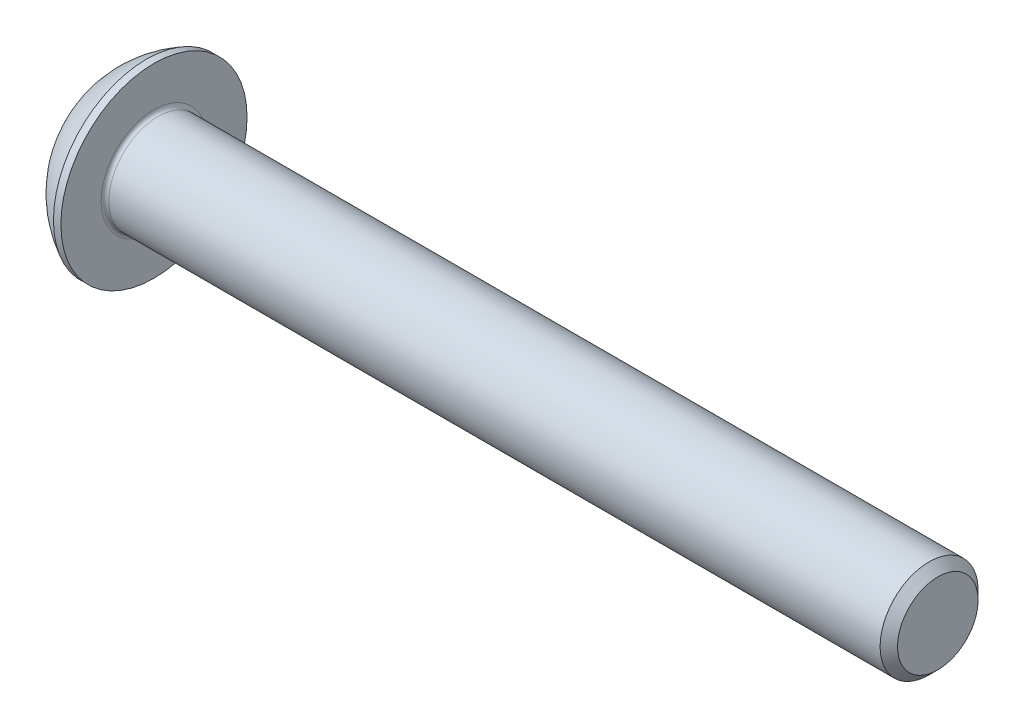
ISO-10303-21;
HEADER;
FILE_DESCRIPTION(('STEP AP214'),'2;1');
FILE_NAME('part.step','',(''),(''),'','','');
FILE_SCHEMA(('AUTOMOTIVE_DESIGN { 1 0 10303 214 1 1 1 1 }'));
ENDSEC;
DATA;
#1=APPLICATION_CONTEXT('core data for automotive mechanical design processes');
#2=APPLICATION_PROTOCOL_DEFINITION('international standard','automotive_design',2000,#1);
#3=PRODUCT_CONTEXT('',#1,'mechanical');
#4=PRODUCT('Part','Part','',(#3));
#5=PRODUCT_RELATED_PRODUCT_CATEGORY('part','',(#4));
#6=PRODUCT_DEFINITION_FORMATION('','',#4);
#7=PRODUCT_DEFINITION_CONTEXT('part definition',#1,'design');
#8=PRODUCT_DEFINITION('design','',#6,#7);
#9=PRODUCT_DEFINITION_SHAPE('','',#8);
#10=(LENGTH_UNIT() NAMED_UNIT(*) SI_UNIT(.MILLI.,.METRE.));
#11=(NAMED_UNIT(*) PLANE_ANGLE_UNIT() SI_UNIT($,.RADIAN.));
#12=(NAMED_UNIT(*) SI_UNIT($,.STERADIAN.) SOLID_ANGLE_UNIT());
#13=UNCERTAINTY_MEASURE_WITH_UNIT(LENGTH_MEASURE(1.E-05),#10,'distance_accuracy_value','');
#14=(GEOMETRIC_REPRESENTATION_CONTEXT(3) GLOBAL_UNCERTAINTY_ASSIGNED_CONTEXT((#13)) GLOBAL_UNIT_ASSIGNED_CONTEXT((#10,
#11,#12)) REPRESENTATION_CONTEXT('',''));
#15=CARTESIAN_POINT('',(0.,0.,0.));
#16=DIRECTION('',(0.,0.,1.));
#17=DIRECTION('',(1.,0.,0.));
#18=AXIS2_PLACEMENT_3D('',#15,#16,#17);
#19=CARTESIAN_POINT('',(0.,0.,0.));
#20=DIRECTION('',(-1.,0.,0.));
#21=DIRECTION('',(0.,0.,1.));
#22=AXIS2_PLACEMENT_3D('',#19,#20,#21);
#23=PLANE('',#22);
#24=CARTESIAN_POINT('',(0.,0.,0.));
#25=DIRECTION('',(-1.,0.,0.));
#26=DIRECTION('',(0.,0.,1.));
#27=AXIS2_PLACEMENT_3D('',#24,#25,#26);
#28=CIRCLE('',#27,2.375);
#29=CARTESIAN_POINT('',(0.,2.375,0.));
#30=VERTEX_POINT('',#29);
#31=EDGE_CURVE('E151',#30,#30,#28,.T.);
#32=ORIENTED_EDGE('',*,*,#31,.T.);
#33=EDGE_LOOP('',(#32));
#34=FACE_BOUND('',#33,.T.);
#35=DIRECTION('',(0.,-1.,0.));
#36=VECTOR('',#35,1.);
#37=CARTESIAN_POINT('',(0.,-0.866025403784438,1.5));
#38=LINE('',#37,#36);
#39=CARTESIAN_POINT('',(0.,0.866025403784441,1.5));
#40=VERTEX_POINT('',#39);
#41=CARTESIAN_POINT('',(0.,-0.866025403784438,1.5));
#42=VERTEX_POINT('',#41);
#43=EDGE_CURVE('E46',#40,#42,#38,.T.);
#44=ORIENTED_EDGE('',*,*,#43,.T.);
#45=DIRECTION('',(0.,-0.5,-0.866025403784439));
#46=VECTOR('',#45,1.);
#47=CARTESIAN_POINT('',(0.,-1.73205080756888,0.));
#48=LINE('',#47,#46);
#49=CARTESIAN_POINT('',(0.,-1.73205080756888,0.));
#50=VERTEX_POINT('',#49);
#51=EDGE_CURVE('E271',#42,#50,#48,.T.);
#52=ORIENTED_EDGE('',*,*,#51,.T.);
#53=DIRECTION('',(0.,0.5,-0.866025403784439));
#54=VECTOR('',#53,1.);
#55=CARTESIAN_POINT('',(0.,-0.866025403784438,-1.5));
#56=LINE('',#55,#54);
#57=CARTESIAN_POINT('',(0.,-0.866025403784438,-1.5));
#58=VERTEX_POINT('',#57);
#59=EDGE_CURVE('E126',#50,#58,#56,.T.);
#60=ORIENTED_EDGE('',*,*,#59,.T.);
#61=DIRECTION('',(0.,1.,0.));
#62=VECTOR('',#61,1.);
#63=CARTESIAN_POINT('',(0.,0.866025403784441,-1.5));
#64=LINE('',#63,#62);
#65=CARTESIAN_POINT('',(0.,0.866025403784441,-1.5));
#66=VERTEX_POINT('',#65);
#67=EDGE_CURVE('E274',#58,#66,#64,.T.);
#68=ORIENTED_EDGE('',*,*,#67,.T.);
#69=DIRECTION('',(0.,0.499999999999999,0.866025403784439));
#70=VECTOR('',#69,1.);
#71=CARTESIAN_POINT('',(0.,1.73205080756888,0.));
#72=LINE('',#71,#70);
#73=CARTESIAN_POINT('',(0.,1.73205080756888,0.));
#74=VERTEX_POINT('',#73);
#75=EDGE_CURVE('E276',#66,#74,#72,.T.);
#76=ORIENTED_EDGE('',*,*,#75,.T.);
#77=DIRECTION('',(0.,-0.499999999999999,0.866025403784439));
#78=VECTOR('',#77,1.);
#79=CARTESIAN_POINT('',(0.,0.866025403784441,1.5));
#80=LINE('',#79,#78);
#81=EDGE_CURVE('E278',#74,#40,#80,.T.);
#82=ORIENTED_EDGE('',*,*,#81,.T.);
#83=EDGE_LOOP('',(#44,#52,#60,#68,#76,#82));
#84=FACE_BOUND('',#83,.T.);
#85=ADVANCED_FACE('F31',(#34,#84),#23,.T.);
#86=CARTESIAN_POINT('',(4.75501582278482,0.,0.));
#87=DIRECTION('',(-1.,0.,0.));
#88=DIRECTION('',(0.,1.,0.));
#89=AXIS2_PLACEMENT_3D('',#86,#87,#88);
#90=SPHERICAL_SURFACE('',#89,5.3151482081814);
#91=CARTESIAN_POINT('',(2.37,0.,0.));
#92=DIRECTION('',(-1.,0.,0.));
#93=DIRECTION('',(0.,0.,1.));
#94=AXIS2_PLACEMENT_3D('',#91,#92,#93);
#95=CIRCLE('',#94,4.75);
#96=CARTESIAN_POINT('',(2.37,4.75,0.));
#97=VERTEX_POINT('',#96);
#98=EDGE_CURVE('E148',#97,#97,#95,.T.);
#99=CARTESIAN_POINT('',(2.37,4.75,0.));
#100=CARTESIAN_POINT('',(2.33822259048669,4.7340443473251,0.));
#101=CARTESIAN_POINT('',(2.30660534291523,4.71776971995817,0.));
#102=CARTESIAN_POINT('',(2.24370380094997,4.68458927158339,0.));
#103=CARTESIAN_POINT('',(2.21241950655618,4.66768345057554,0.));
#104=CARTESIAN_POINT('',(2.15019650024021,4.6332473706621,0.));
#105=CARTESIAN_POINT('',(2.11925778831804,4.6157171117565,0.));
#106=CARTESIAN_POINT('',(2.05773840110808,4.58003923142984,0.));
#107=CARTESIAN_POINT('',(2.02715772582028,4.56189161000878,0.));
#108=CARTESIAN_POINT('',(1.96636673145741,4.52498631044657,0.));
#109=CARTESIAN_POINT('',(1.93615641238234,4.50622863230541,0.));
#110=CARTESIAN_POINT('',(1.87611829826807,4.46811077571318,0.));
#111=CARTESIAN_POINT('',(1.84629050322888,4.4487505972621,0.));
#112=CARTESIAN_POINT('',(1.78702945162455,4.40943553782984,0.));
#113=CARTESIAN_POINT('',(1.75759619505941,4.38948065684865,0.));
#114=CARTESIAN_POINT('',(1.69913607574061,4.34898423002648,0.));
#115=CARTESIAN_POINT('',(1.67010921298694,4.32844268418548,0.));
#116=CARTESIAN_POINT('',(1.61247357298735,4.28678120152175,0.));
#117=CARTESIAN_POINT('',(1.58386479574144,4.265661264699,0.));
#118=CARTESIAN_POINT('',(1.52707685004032,4.22285150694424,0.));
#119=CARTESIAN_POINT('',(1.49889768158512,4.20116168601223,0.));
#120=CARTESIAN_POINT('',(1.44298030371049,4.15722089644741,0.));
#121=CARTESIAN_POINT('',(1.41524209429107,4.13496992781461,0.));
#122=CARTESIAN_POINT('',(1.36021780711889,4.08991580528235,0.));
#123=CARTESIAN_POINT('',(1.33293172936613,4.06711265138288,0.));
#124=CARTESIAN_POINT('',(1.278822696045,4.02096334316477,0.));
#125=CARTESIAN_POINT('',(1.25199974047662,3.99761718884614,0.));
#126=CARTESIAN_POINT('',(1.19882775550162,3.95039128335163,0.));
#127=CARTESIAN_POINT('',(1.172478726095,3.92651153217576,0.));
#128=CARTESIAN_POINT('',(1.1202652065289,3.87822805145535,0.));
#129=CARTESIAN_POINT('',(1.09440071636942,3.85382432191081,0.));
#130=CARTESIAN_POINT('',(1.04316669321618,3.8045027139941,0.));
#131=CARTESIAN_POINT('',(1.01779716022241,3.77958483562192,0.));
#132=CARTESIAN_POINT('',(0.967563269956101,3.72924496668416,0.));
#133=CARTESIAN_POINT('',(0.942698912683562,3.70382297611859,0.));
#134=CARTESIAN_POINT('',(0.89348538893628,3.65248512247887,0.));
#135=CARTESIAN_POINT('',(0.869136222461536,3.62656925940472,0.));
#136=CARTESIAN_POINT('',(0.82096288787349,3.57425409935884,0.));
#137=CARTESIAN_POINT('',(0.797138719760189,3.54785480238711,0.));
#138=CARTESIAN_POINT('',(0.750024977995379,3.49458340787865,0.));
#139=CARTESIAN_POINT('',(0.72673540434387,3.46771131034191,0.));
#140=CARTESIAN_POINT('',(0.680700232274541,3.41350513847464,0.));
#141=CARTESIAN_POINT('',(0.657954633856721,3.3861710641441,0.));
#142=CARTESIAN_POINT('',(0.613016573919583,3.33105194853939,0.));
#143=CARTESIAN_POINT('',(0.590824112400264,3.30326690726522,0.));
#144=CARTESIAN_POINT('',(0.547001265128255,3.24725704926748,0.));
#145=CARTESIAN_POINT('',(0.525370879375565,3.21903223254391,0.));
#146=CARTESIAN_POINT('',(0.48268089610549,3.16215419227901,0.));
#147=CARTESIAN_POINT('',(0.461621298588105,3.13350096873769,0.));
#148=CARTESIAN_POINT('',(0.420081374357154,3.07577765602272,0.));
#149=CARTESIAN_POINT('',(0.399601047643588,3.04670756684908,0.));
#150=CARTESIAN_POINT('',(0.359227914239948,2.98816223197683,0.));
#151=CARTESIAN_POINT('',(0.339335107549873,2.95868698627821,0.));
#152=CARTESIAN_POINT('',(0.300145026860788,2.89934321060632,0.));
#153=CARTESIAN_POINT('',(0.280847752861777,2.86947468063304,0.));
#154=CARTESIAN_POINT('',(0.242856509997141,2.80935636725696,0.));
#155=CARTESIAN_POINT('',(0.224162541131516,2.77910658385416,0.));
#156=CARTESIAN_POINT('',(0.187385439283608,2.71823794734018,0.));
#157=CARTESIAN_POINT('',(0.169302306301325,2.68761909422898,0.));
#158=CARTESIAN_POINT('',(0.133754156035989,2.626024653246,0.));
#159=CARTESIAN_POINT('',(0.116289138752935,2.59504906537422,0.));
#160=CARTESIAN_POINT('',(0.081984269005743,2.53275362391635,0.));
#161=CARTESIAN_POINT('',(0.065144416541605,2.50143377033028,0.));
#162=CARTESIAN_POINT('',(0.0320966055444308,2.43846244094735,0.));
#163=CARTESIAN_POINT('',(0.0158886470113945,2.40681096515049,0.));
#164=CARTESIAN_POINT('',(0.,2.375,0.));
#165=B_SPLINE_CURVE_WITH_KNOTS('',3,(#99,#100,#101,#102,#103,#104,#105,#106,#107,#108,#109,#110,
#111,#112,#113,#114,#115,#116,#117,#118,#119,#120,#121,#122,#123,#124,#125,#126,#127,#128,#129,
#130,#131,#132,#133,#134,#135,#136,#137,#138,#139,#140,#141,#142,#143,#144,#145,#146,#147,#148,
#149,#150,#151,#152,#153,#154,#155,#156,#157,#158,#159,#160,#161,#162,#163,#164),.UNSPECIFIED.,
.F.,.F.,(4,2,2,2,2,2,2,2,2,2,2,2,2,2,2,2,2,2,2,2,2,2,2,2,2,2,2,2,2,2,2,2,4),(0.,
0.106672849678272,0.213345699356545,0.320018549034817,0.426691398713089,0.533364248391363,
0.640037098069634,0.746709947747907,0.85338279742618,0.960055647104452,1.06672849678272,
1.173401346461,1.28007419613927,1.38674704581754,1.49341989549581,1.60009274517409,
1.70676559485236,1.81343844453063,1.9201112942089,2.02678414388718,2.13345699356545,
2.24012984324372,2.34680269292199,2.45347554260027,2.56014839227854,2.66682124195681,
2.77349409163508,2.88016694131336,2.98683979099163,3.0935126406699,3.20018549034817,
3.30685834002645,3.41353118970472),.UNSPECIFIED.);
#166=EDGE_CURVE('BSEAM172',#97,#30,#165,.T.);
#167=ORIENTED_EDGE('',*,*,#98,.T.);
#168=ORIENTED_EDGE('',*,*,#31,.F.);
#169=ORIENTED_EDGE('',*,*,#166,.T.);
#170=ORIENTED_EDGE('',*,*,#166,.F.);
#171=EDGE_LOOP('',(#167,#169,#168,#170));
#172=FACE_BOUND('',#171,.T.);
#173=ADVANCED_FACE('F172',(#172),#90,.T.);
#174=CARTESIAN_POINT('',(0.,0.,0.));
#175=DIRECTION('',(-1.,0.,0.));
#176=DIRECTION('',(0.,0.,1.));
#177=AXIS2_PLACEMENT_3D('',#174,#175,#176);
#178=CYLINDRICAL_SURFACE('',#177,4.75);
#179=ORIENTED_EDGE('',*,*,#98,.F.);
#180=EDGE_LOOP('',(#179));
#181=FACE_BOUND('',#180,.T.);
#182=CARTESIAN_POINT('',(2.75,0.,0.));
#183=DIRECTION('',(-1.,0.,0.));
#184=DIRECTION('',(0.,0.,1.));
#185=AXIS2_PLACEMENT_3D('',#182,#183,#184);
#186=CIRCLE('',#185,4.75);
#187=CARTESIAN_POINT('',(2.75,0.,4.75));
#188=VERTEX_POINT('',#187);
#189=EDGE_CURVE('E145',#188,#188,#186,.T.);
#190=ORIENTED_EDGE('',*,*,#189,.T.);
#191=EDGE_LOOP('',(#190));
#192=FACE_BOUND('',#191,.T.);
#193=ADVANCED_FACE('F177',(#181,#192),#178,.T.);
#194=CARTESIAN_POINT('',(2.75,2.49999999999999,0.));
#195=DIRECTION('',(-1.,0.,0.));
#196=DIRECTION('',(0.,0.,1.));
#197=AXIS2_PLACEMENT_3D('',#194,#195,#196);
#198=PLANE('',#197);
#199=CARTESIAN_POINT('',(2.75,0.,0.));
#200=DIRECTION('',(-1.,0.,0.));
#201=DIRECTION('',(0.,0.,1.));
#202=AXIS2_PLACEMENT_3D('',#199,#200,#201);
#203=CIRCLE('',#202,2.7);
#204=CARTESIAN_POINT('',(2.75,0.,2.7));
#205=VERTEX_POINT('',#204);
#206=EDGE_CURVE('E39',#205,#205,#203,.T.);
#207=ORIENTED_EDGE('',*,*,#206,.T.);
#208=EDGE_LOOP('',(#207));
#209=FACE_BOUND('',#208,.T.);
#210=ORIENTED_EDGE('',*,*,#189,.F.);
#211=EDGE_LOOP('',(#210));
#212=FACE_BOUND('',#211,.T.);
#213=ADVANCED_FACE('F156',(#209,#212),#198,.F.);
#214=CARTESIAN_POINT('',(0.,0.,0.));
#215=DIRECTION('',(-1.,0.,0.));
#216=DIRECTION('',(0.,0.,1.));
#217=AXIS2_PLACEMENT_3D('',#214,#215,#216);
#218=CYLINDRICAL_SURFACE('',#217,2.5);
#219=CARTESIAN_POINT('',(2.95,0.,0.));
#220=DIRECTION('',(-1.,0.,0.));
#221=DIRECTION('',(0.,0.,1.));
#222=AXIS2_PLACEMENT_3D('',#219,#220,#221);
#223=CIRCLE('',#222,2.5);
#224=CARTESIAN_POINT('',(2.95,0.,2.5));
#225=VERTEX_POINT('',#224);
#226=EDGE_CURVE('E11',#225,#225,#223,.F.);
#227=ORIENTED_EDGE('',*,*,#226,.T.);
#228=EDGE_LOOP('',(#227));
#229=FACE_BOUND('',#228,.T.);
#230=CARTESIAN_POINT('',(42.305,0.,0.));
#231=DIRECTION('',(-1.,0.,0.));
#232=DIRECTION('',(0.,0.,1.));
#233=AXIS2_PLACEMENT_3D('',#230,#231,#232);
#234=CIRCLE('',#233,2.5);
#235=CARTESIAN_POINT('',(42.305,0.,2.5));
#236=VERTEX_POINT('',#235);
#237=EDGE_CURVE('E142',#236,#236,#234,.T.);
#238=ORIENTED_EDGE('',*,*,#237,.T.);
#239=EDGE_LOOP('',(#238));
#240=FACE_BOUND('',#239,.T.);
#241=ADVANCED_FACE('F186',(#229,#240),#218,.T.);
#242=CARTESIAN_POINT('',(42.75,0.,0.));
#243=DIRECTION('',(-1.,0.,0.));
#244=DIRECTION('',(0.,0.,1.));
#245=AXIS2_PLACEMENT_3D('',#242,#243,#244);
#246=CONICAL_SURFACE('',#245,2.055,0.785398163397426);
#247=ORIENTED_EDGE('',*,*,#237,.F.);
#248=EDGE_LOOP('',(#247));
#249=FACE_BOUND('',#248,.T.);
#250=CARTESIAN_POINT('',(42.75,0.,0.));
#251=DIRECTION('',(-1.,0.,0.));
#252=DIRECTION('',(0.,0.,1.));
#253=AXIS2_PLACEMENT_3D('',#250,#251,#252);
#254=CIRCLE('',#253,2.055);
#255=CARTESIAN_POINT('',(42.75,0.,2.055));
#256=VERTEX_POINT('',#255);
#257=EDGE_CURVE('E138',#256,#256,#254,.T.);
#258=ORIENTED_EDGE('',*,*,#257,.T.);
#259=EDGE_LOOP('',(#258));
#260=FACE_BOUND('',#259,.T.);
#261=ADVANCED_FACE('F167',(#249,#260),#246,.T.);
#262=CARTESIAN_POINT('',(42.75,0.,0.));
#263=DIRECTION('',(-1.,0.,0.));
#264=DIRECTION('',(0.,0.,1.));
#265=AXIS2_PLACEMENT_3D('',#262,#263,#264);
#266=PLANE('',#265);
#267=ORIENTED_EDGE('',*,*,#257,.F.);
#268=EDGE_LOOP('',(#267));
#269=FACE_BOUND('',#268,.T.);
#270=ADVANCED_FACE('F160',(#269),#266,.F.);
#271=CARTESIAN_POINT('',(2.95,0.,0.));
#272=DIRECTION('',(-1.,0.,0.));
#273=DIRECTION('',(0.,0.,1.));
#274=AXIS2_PLACEMENT_3D('',#271,#272,#273);
#275=TOROIDAL_SURFACE('',#274,2.7,0.2);
#276=ORIENTED_EDGE('',*,*,#226,.F.);
#277=EDGE_LOOP('',(#276));
#278=FACE_BOUND('',#277,.T.);
#279=ORIENTED_EDGE('',*,*,#206,.F.);
#280=EDGE_LOOP('',(#279));
#281=FACE_BOUND('',#280,.T.);
#282=ADVANCED_FACE('F33',(#278,#281),#275,.F.);
#283=CARTESIAN_POINT('',(1.56,-1.73205080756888,0.));
#284=DIRECTION('',(0.,0.866025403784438,-0.5));
#285=DIRECTION('',(0.,0.5,0.866025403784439));
#286=AXIS2_PLACEMENT_3D('',#283,#284,#285);
#287=PLANE('',#286);
#288=DIRECTION('',(0.,-0.5,-0.866025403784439));
#289=VECTOR('',#288,1.);
#290=CARTESIAN_POINT('',(1.56,-1.73205080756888,0.));
#291=LINE('',#290,#289);
#292=CARTESIAN_POINT('',(1.56,-0.866025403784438,1.5));
#293=VERTEX_POINT('',#292);
#294=CARTESIAN_POINT('',(1.56,-1.29903810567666,0.75));
#295=VERTEX_POINT('',#294);
#296=EDGE_CURVE('E112',#293,#295,#291,.T.);
#297=ORIENTED_EDGE('',*,*,#296,.T.);
#298=CARTESIAN_POINT('',(1.56,-1.73205080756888,0.));
#299=VERTEX_POINT('',#298);
#300=EDGE_CURVE('E107',#295,#299,#291,.T.);
#301=ORIENTED_EDGE('',*,*,#300,.T.);
#302=DIRECTION('',(-1.,0.,0.));
#303=VECTOR('',#302,1.);
#304=CARTESIAN_POINT('',(1.56,-1.73205080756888,0.));
#305=LINE('',#304,#303);
#306=EDGE_CURVE('E109',#299,#50,#305,.T.);
#307=ORIENTED_EDGE('',*,*,#306,.T.);
#308=ORIENTED_EDGE('',*,*,#51,.F.);
#309=DIRECTION('',(-1.,0.,0.));
#310=VECTOR('',#309,1.);
#311=CARTESIAN_POINT('',(1.56,-0.866025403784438,1.5));
#312=LINE('',#311,#310);
#313=EDGE_CURVE('E267',#293,#42,#312,.T.);
#314=ORIENTED_EDGE('',*,*,#313,.F.);
#315=EDGE_LOOP('',(#297,#301,#307,#308,#314));
#316=FACE_BOUND('',#315,.T.);
#317=ADVANCED_FACE('F108',(#316),#287,.T.);
#318=CARTESIAN_POINT('',(1.56,-0.866025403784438,-1.5));
#319=DIRECTION('',(0.,0.866025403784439,0.5));
#320=DIRECTION('',(0.,-0.5,0.866025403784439));
#321=AXIS2_PLACEMENT_3D('',#318,#319,#320);
#322=PLANE('',#321);
#323=DIRECTION('',(0.,0.5,-0.866025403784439));
#324=VECTOR('',#323,1.);
#325=CARTESIAN_POINT('',(1.56,-0.866025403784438,-1.5));
#326=LINE('',#325,#324);
#327=CARTESIAN_POINT('',(1.56,-1.29903810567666,-0.75));
#328=VERTEX_POINT('',#327);
#329=EDGE_CURVE('E54',#299,#328,#326,.T.);
#330=ORIENTED_EDGE('',*,*,#329,.T.);
#331=CARTESIAN_POINT('',(1.56,-0.866025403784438,-1.5));
#332=VERTEX_POINT('',#331);
#333=EDGE_CURVE('E121',#328,#332,#326,.T.);
#334=ORIENTED_EDGE('',*,*,#333,.T.);
#335=DIRECTION('',(-1.,0.,0.));
#336=VECTOR('',#335,1.);
#337=CARTESIAN_POINT('',(1.56,-0.866025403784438,-1.5));
#338=LINE('',#337,#336);
#339=EDGE_CURVE('E128',#332,#58,#338,.T.);
#340=ORIENTED_EDGE('',*,*,#339,.T.);
#341=ORIENTED_EDGE('',*,*,#59,.F.);
#342=ORIENTED_EDGE('',*,*,#306,.F.);
#343=EDGE_LOOP('',(#330,#334,#340,#341,#342));
#344=FACE_BOUND('',#343,.T.);
#345=ADVANCED_FACE('F124',(#344),#322,.T.);
#346=CARTESIAN_POINT('',(1.56,0.866025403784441,-1.5));
#347=DIRECTION('',(0.,0.,1.));
#348=DIRECTION('',(0.,-1.,0.));
#349=AXIS2_PLACEMENT_3D('',#346,#347,#348);
#350=PLANE('',#349);
#351=DIRECTION('',(0.,1.,0.));
#352=VECTOR('',#351,1.);
#353=CARTESIAN_POINT('',(1.56,0.866025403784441,-1.5));
#354=LINE('',#353,#352);
#355=CARTESIAN_POINT('',(1.56,0.,-1.5));
#356=VERTEX_POINT('',#355);
#357=EDGE_CURVE('E248',#332,#356,#354,.T.);
#358=ORIENTED_EDGE('',*,*,#357,.T.);
#359=CARTESIAN_POINT('',(1.56,0.866025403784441,-1.5));
#360=VERTEX_POINT('',#359);
#361=EDGE_CURVE('E120',#356,#360,#354,.T.);
#362=ORIENTED_EDGE('',*,*,#361,.T.);
#363=DIRECTION('',(-1.,0.,0.));
#364=VECTOR('',#363,1.);
#365=CARTESIAN_POINT('',(1.56,0.866025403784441,-1.5));
#366=LINE('',#365,#364);
#367=EDGE_CURVE('E133',#360,#66,#366,.T.);
#368=ORIENTED_EDGE('',*,*,#367,.T.);
#369=ORIENTED_EDGE('',*,*,#67,.F.);
#370=ORIENTED_EDGE('',*,*,#339,.F.);
#371=EDGE_LOOP('',(#358,#362,#368,#369,#370));
#372=FACE_BOUND('',#371,.T.);
#373=ADVANCED_FACE('F200',(#372),#350,.T.);
#374=CARTESIAN_POINT('',(1.56,1.73205080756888,0.));
#375=DIRECTION('',(0.,-0.866025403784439,0.499999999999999));
#376=DIRECTION('',(0.,-0.499999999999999,-0.866025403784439));
#377=AXIS2_PLACEMENT_3D('',#374,#375,#376);
#378=PLANE('',#377);
#379=DIRECTION('',(0.,0.499999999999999,0.866025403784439));
#380=VECTOR('',#379,1.);
#381=CARTESIAN_POINT('',(1.56,1.73205080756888,0.));
#382=LINE('',#381,#380);
#383=CARTESIAN_POINT('',(1.56,1.29903810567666,-0.75));
#384=VERTEX_POINT('',#383);
#385=EDGE_CURVE('E237',#360,#384,#382,.T.);
#386=ORIENTED_EDGE('',*,*,#385,.T.);
#387=CARTESIAN_POINT('',(1.56,1.73205080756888,0.));
#388=VERTEX_POINT('',#387);
#389=EDGE_CURVE('E242',#384,#388,#382,.T.);
#390=ORIENTED_EDGE('',*,*,#389,.T.);
#391=DIRECTION('',(-1.,0.,0.));
#392=VECTOR('',#391,1.);
#393=CARTESIAN_POINT('',(1.56,1.73205080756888,0.));
#394=LINE('',#393,#392);
#395=EDGE_CURVE('E282',#388,#74,#394,.T.);
#396=ORIENTED_EDGE('',*,*,#395,.T.);
#397=ORIENTED_EDGE('',*,*,#75,.F.);
#398=ORIENTED_EDGE('',*,*,#367,.F.);
#399=EDGE_LOOP('',(#386,#390,#396,#397,#398));
#400=FACE_BOUND('',#399,.T.);
#401=ADVANCED_FACE('F203',(#400),#378,.T.);
#402=CARTESIAN_POINT('',(1.56,0.866025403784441,1.5));
#403=DIRECTION('',(0.,-0.866025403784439,-0.499999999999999));
#404=DIRECTION('',(0.,0.499999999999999,-0.866025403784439));
#405=AXIS2_PLACEMENT_3D('',#402,#403,#404);
#406=PLANE('',#405);
#407=DIRECTION('',(0.,-0.499999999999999,0.866025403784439));
#408=VECTOR('',#407,1.);
#409=CARTESIAN_POINT('',(1.56,0.866025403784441,1.5));
#410=LINE('',#409,#408);
#411=CARTESIAN_POINT('',(1.56,1.29903810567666,0.749999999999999));
#412=VERTEX_POINT('',#411);
#413=EDGE_CURVE('E245',#388,#412,#410,.T.);
#414=ORIENTED_EDGE('',*,*,#413,.T.);
#415=CARTESIAN_POINT('',(1.56,0.866025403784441,1.5));
#416=VERTEX_POINT('',#415);
#417=EDGE_CURVE('E253',#412,#416,#410,.T.);
#418=ORIENTED_EDGE('',*,*,#417,.T.);
#419=DIRECTION('',(-1.,0.,0.));
#420=VECTOR('',#419,1.);
#421=CARTESIAN_POINT('',(1.56,0.866025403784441,1.5));
#422=LINE('',#421,#420);
#423=EDGE_CURVE('E266',#416,#40,#422,.T.);
#424=ORIENTED_EDGE('',*,*,#423,.T.);
#425=ORIENTED_EDGE('',*,*,#81,.F.);
#426=ORIENTED_EDGE('',*,*,#395,.F.);
#427=EDGE_LOOP('',(#414,#418,#424,#425,#426));
#428=FACE_BOUND('',#427,.T.);
#429=ADVANCED_FACE('F207',(#428),#406,.T.);
#430=CARTESIAN_POINT('',(1.56,-0.866025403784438,1.5));
#431=DIRECTION('',(0.,0.,-1.));
#432=DIRECTION('',(0.,1.,0.));
#433=AXIS2_PLACEMENT_3D('',#430,#431,#432);
#434=PLANE('',#433);
#435=DIRECTION('',(0.,-1.,0.));
#436=VECTOR('',#435,1.);
#437=CARTESIAN_POINT('',(1.56,-0.866025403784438,1.5));
#438=LINE('',#437,#436);
#439=CARTESIAN_POINT('',(1.56,0.,1.5));
#440=VERTEX_POINT('',#439);
#441=EDGE_CURVE('E259',#416,#440,#438,.T.);
#442=ORIENTED_EDGE('',*,*,#441,.T.);
#443=EDGE_CURVE('E261',#440,#293,#438,.T.);
#444=ORIENTED_EDGE('',*,*,#443,.T.);
#445=ORIENTED_EDGE('',*,*,#313,.T.);
#446=ORIENTED_EDGE('',*,*,#43,.F.);
#447=ORIENTED_EDGE('',*,*,#423,.F.);
#448=EDGE_LOOP('',(#442,#444,#445,#446,#447));
#449=FACE_BOUND('',#448,.T.);
#450=ADVANCED_FACE('F211',(#449),#434,.T.);
#451=CARTESIAN_POINT('',(1.56,-1.73205080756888,0.));
#452=DIRECTION('',(1.,0.,0.));
#453=DIRECTION('',(0.,0.,-1.));
#454=AXIS2_PLACEMENT_3D('',#451,#452,#453);
#455=PLANE('',#454);
#456=CARTESIAN_POINT('',(1.56,0.,0.));
#457=DIRECTION('',(-1.,0.,0.));
#458=DIRECTION('',(0.,0.,1.));
#459=AXIS2_PLACEMENT_3D('',#456,#457,#458);
#460=CIRCLE('',#459,1.5);
#461=EDGE_CURVE('E234',#384,#356,#460,.T.);
#462=ORIENTED_EDGE('',*,*,#461,.F.);
#463=ORIENTED_EDGE('',*,*,#385,.F.);
#464=ORIENTED_EDGE('',*,*,#361,.F.);
#465=EDGE_LOOP('',(#462,#463,#464));
#466=FACE_BOUND('',#465,.T.);
#467=ADVANCED_FACE('F215',(#466),#455,.F.);
#468=EDGE_CURVE('E139',#412,#384,#460,.T.);
#469=ORIENTED_EDGE('',*,*,#468,.F.);
#470=ORIENTED_EDGE('',*,*,#413,.F.);
#471=ORIENTED_EDGE('',*,*,#389,.F.);
#472=EDGE_LOOP('',(#469,#470,#471));
#473=FACE_BOUND('',#472,.T.);
#474=ADVANCED_FACE('F224',(#473),#455,.F.);
#475=EDGE_CURVE('E132',#440,#412,#460,.T.);
#476=ORIENTED_EDGE('',*,*,#475,.F.);
#477=ORIENTED_EDGE('',*,*,#441,.F.);
#478=ORIENTED_EDGE('',*,*,#417,.F.);
#479=EDGE_LOOP('',(#476,#477,#478));
#480=FACE_BOUND('',#479,.T.);
#481=ADVANCED_FACE('F229',(#480),#455,.F.);
#482=EDGE_CURVE('E127',#295,#440,#460,.T.);
#483=ORIENTED_EDGE('',*,*,#482,.F.);
#484=ORIENTED_EDGE('',*,*,#296,.F.);
#485=ORIENTED_EDGE('',*,*,#443,.F.);
#486=EDGE_LOOP('',(#483,#484,#485));
#487=FACE_BOUND('',#486,.T.);
#488=ADVANCED_FACE('F222',(#487),#455,.F.);
#489=EDGE_CURVE('E118',#328,#295,#460,.T.);
#490=ORIENTED_EDGE('',*,*,#489,.F.);
#491=ORIENTED_EDGE('',*,*,#329,.F.);
#492=ORIENTED_EDGE('',*,*,#300,.F.);
#493=EDGE_LOOP('',(#490,#491,#492));
#494=FACE_BOUND('',#493,.T.);
#495=ADVANCED_FACE('F117',(#494),#455,.F.);
#496=EDGE_CURVE('E240',#356,#328,#460,.T.);
#497=ORIENTED_EDGE('',*,*,#496,.F.);
#498=ORIENTED_EDGE('',*,*,#357,.F.);
#499=ORIENTED_EDGE('',*,*,#333,.F.);
#500=EDGE_LOOP('',(#497,#498,#499));
#501=FACE_BOUND('',#500,.T.);
#502=ADVANCED_FACE('F195',(#501),#455,.F.);
#503=CARTESIAN_POINT('',(2.42602540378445,0.,0.));
#504=DIRECTION('',(-1.,0.,0.));
#505=DIRECTION('',(0.,0.,1.));
#506=AXIS2_PLACEMENT_3D('',#503,#504,#505);
#507=CONICAL_SURFACE('',#506,0.,1.04719755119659);
#508=ORIENTED_EDGE('',*,*,#475,.T.);
#509=ORIENTED_EDGE('',*,*,#468,.T.);
#510=ORIENTED_EDGE('',*,*,#461,.T.);
#511=ORIENTED_EDGE('',*,*,#496,.T.);
#512=ORIENTED_EDGE('',*,*,#489,.T.);
#513=ORIENTED_EDGE('',*,*,#482,.T.);
#514=EDGE_LOOP('',(#508,#509,#510,#511,#512,#513));
#515=FACE_BOUND('',#514,.T.);
#516=CARTESIAN_POINT('',(2.42602540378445,0.,0.));
#517=VERTEX_POINT('',#516);
#518=VERTEX_LOOP('',#517);
#519=FACE_BOUND('',#518,.T.);
#520=ADVANCED_FACE('F193',(#515,#519),#507,.F.);
#521=CLOSED_SHELL('',(#85,#173,#193,#213,#241,#261,#270,#282,#317,#345,#373,#401,#429,#450,#467,
#474,#481,#488,#495,#502,#520));
#522=MANIFOLD_SOLID_BREP('B2',#521);
#523=ADVANCED_BREP_SHAPE_REPRESENTATION('',(#18,#522),#14);
#524=SHAPE_DEFINITION_REPRESENTATION(#9,#523);
ENDSEC;
END-ISO-10303-21;
